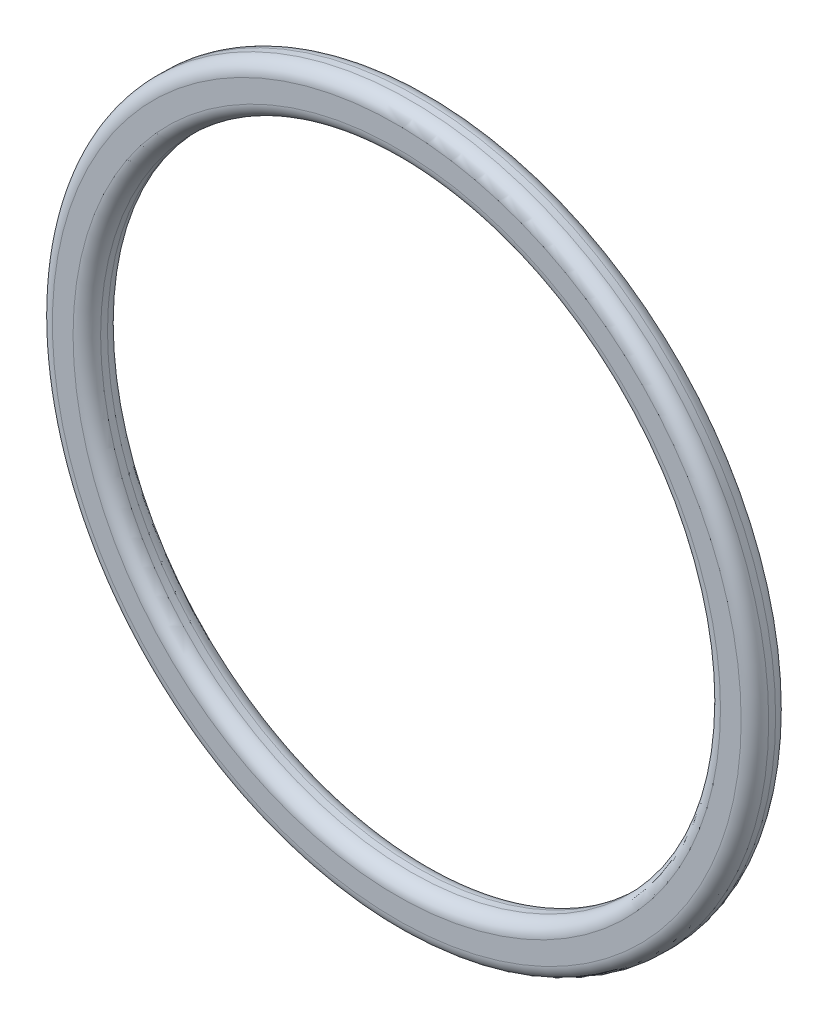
from build123d import *


with BuildPart() as part:
    # Esquisse1 → R_volution1 (revolve)
    with BuildSketch(Plane(origin=(0, 0, 0), x_dir=(0, 0, -1), z_dir=(1, 0, 0)), mode=Mode.PRIVATE) as r_volution1_sk:
        with BuildLine():
            Line((1.459361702, 26), (1.959361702, 26))
            ThreePointArc((1.959361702, 26), (2.666468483, 25.707106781), (2.959361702, 25))
            Line((2.959361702, 25), (2.959361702, 23.5))
            ThreePointArc((2.959361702, 23.5), (2.666468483, 22.792893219), (1.959361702, 22.5))
            Line((1.959361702, 22.5), (1.459361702, 22.5))
            ThreePointArc((1.459361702, 22.5), (0.752254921, 22.792893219), (0.459361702, 23.5))
            Line((0.459361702, 23.5), (0.459361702, 25))
            ThreePointArc((0.459361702, 25), (0.752254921, 25.707106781), (1.459361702, 26))
        make_face()
    revolve(r_volution1_sk.sketch.rotate(Axis((0, 0, 20.824397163), (0, 0, -1)), 90), axis=Axis((0, 0, 20.824397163), (0, 0, -1)))


solid = part.part
